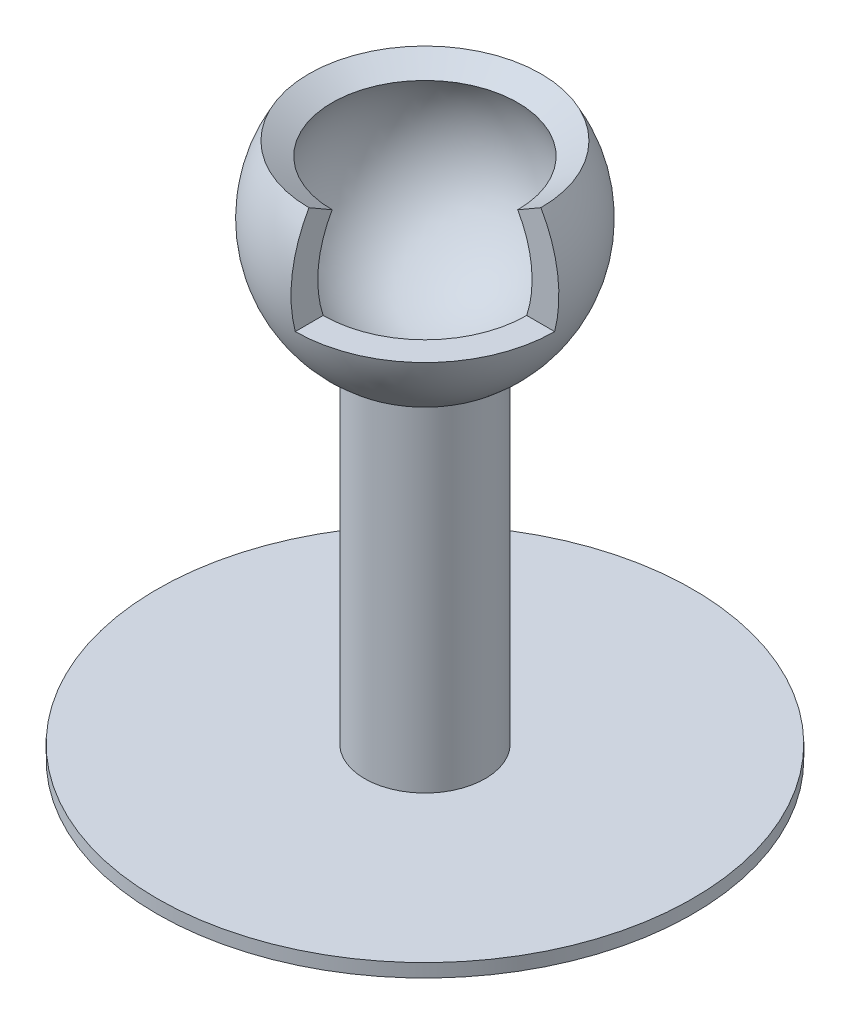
ISO-10303-21;
HEADER;
FILE_DESCRIPTION(('STEP AP214'),'2;1');
FILE_NAME('part.step','',(''),(''),'','','');
FILE_SCHEMA(('AUTOMOTIVE_DESIGN { 1 0 10303 214 1 1 1 1 }'));
ENDSEC;
DATA;
#1=APPLICATION_CONTEXT('core data for automotive mechanical design processes');
#2=APPLICATION_PROTOCOL_DEFINITION('international standard','automotive_design',2000,#1);
#3=PRODUCT_CONTEXT('',#1,'mechanical');
#4=PRODUCT('Part','Part','',(#3));
#5=PRODUCT_RELATED_PRODUCT_CATEGORY('part','',(#4));
#6=PRODUCT_DEFINITION_FORMATION('','',#4);
#7=PRODUCT_DEFINITION_CONTEXT('part definition',#1,'design');
#8=PRODUCT_DEFINITION('design','',#6,#7);
#9=PRODUCT_DEFINITION_SHAPE('','',#8);
#10=(LENGTH_UNIT() NAMED_UNIT(*) SI_UNIT(.MILLI.,.METRE.));
#11=(NAMED_UNIT(*) PLANE_ANGLE_UNIT() SI_UNIT($,.RADIAN.));
#12=(NAMED_UNIT(*) SI_UNIT($,.STERADIAN.) SOLID_ANGLE_UNIT());
#13=UNCERTAINTY_MEASURE_WITH_UNIT(LENGTH_MEASURE(1.E-05),#10,'distance_accuracy_value','');
#14=(GEOMETRIC_REPRESENTATION_CONTEXT(3) GLOBAL_UNCERTAINTY_ASSIGNED_CONTEXT((#13)) GLOBAL_UNIT_ASSIGNED_CONTEXT((#10,
#11,#12)) REPRESENTATION_CONTEXT('',''));
#15=CARTESIAN_POINT('',(0.,0.,0.));
#16=DIRECTION('',(0.,0.,1.));
#17=DIRECTION('',(1.,0.,0.));
#18=AXIS2_PLACEMENT_3D('',#15,#16,#17);
#19=CARTESIAN_POINT('',(0.,0.,0.));
#20=DIRECTION('',(0.,1.,0.));
#21=DIRECTION('',(-1.,0.,0.));
#22=AXIS2_PLACEMENT_3D('',#19,#20,#21);
#23=SPHERICAL_SURFACE('',#22,20.);
#24=CARTESIAN_POINT('',(0.,-17.8605710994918,0.));
#25=DIRECTION('',(0.,1.,0.));
#26=DIRECTION('',(0.,0.,1.));
#27=AXIS2_PLACEMENT_3D('',#24,#25,#26);
#28=CIRCLE('',#27,9.);
#29=CARTESIAN_POINT('',(0.,-17.8605710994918,9.));
#30=VERTEX_POINT('',#29);
#31=EDGE_CURVE('E92',#30,#30,#28,.T.);
#32=ORIENTED_EDGE('',*,*,#31,.T.);
#33=EDGE_LOOP('',(#32));
#34=FACE_BOUND('',#33,.T.);
#35=CARTESIAN_POINT('',(0.,0.,0.));
#36=DIRECTION('',(1.,0.,0.));
#37=DIRECTION('',(0.,0.,-1.));
#38=AXIS2_PLACEMENT_3D('',#35,#36,#37);
#39=CIRCLE('',#38,20.);
#40=CARTESIAN_POINT('',(0.,10.0000000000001,17.3205080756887));
#41=VERTEX_POINT('',#40);
#42=CARTESIAN_POINT('',(0.,-4.99999999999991,19.3649167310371));
#43=VERTEX_POINT('',#42);
#44=EDGE_CURVE('E74',#41,#43,#39,.T.);
#45=ORIENTED_EDGE('',*,*,#44,.F.);
#46=CARTESIAN_POINT('',(0.,10.0000000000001,0.));
#47=DIRECTION('',(0.,1.,0.));
#48=DIRECTION('',(0.,0.,1.));
#49=AXIS2_PLACEMENT_3D('',#46,#47,#48);
#50=CIRCLE('',#49,17.3205080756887);
#51=CARTESIAN_POINT('',(17.3205080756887,10.0000000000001,0.));
#52=VERTEX_POINT('',#51);
#53=EDGE_CURVE('E84',#52,#41,#50,.T.);
#54=ORIENTED_EDGE('',*,*,#53,.F.);
#55=CARTESIAN_POINT('',(0.,0.,0.));
#56=DIRECTION('',(0.,0.,1.));
#57=DIRECTION('',(1.,0.,0.));
#58=AXIS2_PLACEMENT_3D('',#55,#56,#57);
#59=CIRCLE('',#58,20.);
#60=CARTESIAN_POINT('',(19.3649167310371,-4.99999999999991,0.));
#61=VERTEX_POINT('',#60);
#62=EDGE_CURVE('E48',#61,#52,#59,.T.);
#63=ORIENTED_EDGE('',*,*,#62,.F.);
#64=CARTESIAN_POINT('',(0.,-4.99999999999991,0.));
#65=DIRECTION('',(0.,1.,0.));
#66=DIRECTION('',(0.,0.,1.));
#67=AXIS2_PLACEMENT_3D('',#64,#65,#66);
#68=CIRCLE('',#67,19.3649167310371);
#69=EDGE_CURVE('E85',#43,#61,#68,.T.);
#70=ORIENTED_EDGE('',*,*,#69,.F.);
#71=EDGE_LOOP('',(#45,#54,#63,#70));
#72=FACE_BOUND('',#71,.T.);
#73=ADVANCED_FACE('F33',(#34,#72),#23,.T.);
#74=CARTESIAN_POINT('',(0.,0.,0.));
#75=DIRECTION('',(0.,1.,0.));
#76=DIRECTION('',(1.,0.,0.));
#77=AXIS2_PLACEMENT_3D('',#74,#75,#76);
#78=SPHERICAL_SURFACE('',#77,16.);
#79=CARTESIAN_POINT('',(0.,0.,0.));
#80=DIRECTION('',(1.,0.,0.));
#81=DIRECTION('',(0.,0.,-1.));
#82=AXIS2_PLACEMENT_3D('',#79,#80,#81);
#83=CIRCLE('',#82,16.);
#84=CARTESIAN_POINT('',(0.,-4.99999999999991,15.1986841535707));
#85=VERTEX_POINT('',#84);
#86=CARTESIAN_POINT('',(0.,8.00000000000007,13.856406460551));
#87=VERTEX_POINT('',#86);
#88=EDGE_CURVE('E56',#85,#87,#83,.F.);
#89=ORIENTED_EDGE('',*,*,#88,.F.);
#90=CARTESIAN_POINT('',(0.,-4.99999999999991,0.));
#91=DIRECTION('',(0.,1.,0.));
#92=DIRECTION('',(0.,0.,1.));
#93=AXIS2_PLACEMENT_3D('',#90,#91,#92);
#94=CIRCLE('',#93,15.1986841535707);
#95=CARTESIAN_POINT('',(15.1986841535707,-4.99999999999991,0.));
#96=VERTEX_POINT('',#95);
#97=EDGE_CURVE('E11',#96,#85,#94,.F.);
#98=ORIENTED_EDGE('',*,*,#97,.F.);
#99=CARTESIAN_POINT('',(0.,0.,0.));
#100=DIRECTION('',(0.,0.,1.));
#101=DIRECTION('',(1.,0.,0.));
#102=AXIS2_PLACEMENT_3D('',#99,#100,#101);
#103=CIRCLE('',#102,16.);
#104=CARTESIAN_POINT('',(13.856406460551,8.00000000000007,0.));
#105=VERTEX_POINT('',#104);
#106=EDGE_CURVE('E107',#105,#96,#103,.F.);
#107=ORIENTED_EDGE('',*,*,#106,.F.);
#108=CARTESIAN_POINT('',(0.,8.00000000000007,0.));
#109=DIRECTION('',(0.,1.,0.));
#110=DIRECTION('',(0.,0.,1.));
#111=AXIS2_PLACEMENT_3D('',#108,#109,#110);
#112=CIRCLE('',#111,13.856406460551);
#113=EDGE_CURVE('E89',#105,#87,#112,.T.);
#114=ORIENTED_EDGE('',*,*,#113,.T.);
#115=EDGE_LOOP('',(#89,#98,#107,#114));
#116=FACE_BOUND('',#115,.T.);
#117=ADVANCED_FACE('F111',(#116),#78,.F.);
#118=CARTESIAN_POINT('',(0.,10.0000000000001,0.));
#119=DIRECTION('',(0.,1.,0.));
#120=DIRECTION('',(0.,0.,1.));
#121=AXIS2_PLACEMENT_3D('',#118,#119,#120);
#122=CONICAL_SURFACE('',#121,17.3205080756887,1.04719755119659);
#123=DIRECTION('',(0.,-0.500000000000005,-0.866025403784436));
#124=VECTOR('',#123,1.);
#125=CARTESIAN_POINT('',(0.,0.,0.));
#126=LINE('',#125,#124);
#127=EDGE_CURVE('E41',#87,#41,#126,.F.);
#128=ORIENTED_EDGE('',*,*,#127,.F.);
#129=ORIENTED_EDGE('',*,*,#113,.F.);
#130=DIRECTION('',(0.866025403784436,0.500000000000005,0.));
#131=VECTOR('',#130,1.);
#132=CARTESIAN_POINT('',(0.,0.,0.));
#133=LINE('',#132,#131);
#134=EDGE_CURVE('E80',#52,#105,#133,.F.);
#135=ORIENTED_EDGE('',*,*,#134,.F.);
#136=ORIENTED_EDGE('',*,*,#53,.T.);
#137=EDGE_LOOP('',(#128,#129,#135,#136));
#138=FACE_BOUND('',#137,.T.);
#139=ADVANCED_FACE('F87',(#138),#122,.F.);
#140=CARTESIAN_POINT('',(0.,-68.,0.));
#141=DIRECTION('',(0.,1.,0.));
#142=DIRECTION('',(0.,0.,1.));
#143=AXIS2_PLACEMENT_3D('',#140,#141,#142);
#144=PLANE('',#143);
#145=CARTESIAN_POINT('',(0.,-68.,0.));
#146=DIRECTION('',(0.,1.,0.));
#147=DIRECTION('',(0.,0.,1.));
#148=AXIS2_PLACEMENT_3D('',#145,#146,#147);
#149=CIRCLE('',#148,40.);
#150=CARTESIAN_POINT('',(0.,-68.,40.));
#151=VERTEX_POINT('',#150);
#152=EDGE_CURVE('E100',#151,#151,#149,.T.);
#153=ORIENTED_EDGE('',*,*,#152,.T.);
#154=EDGE_LOOP('',(#153));
#155=FACE_BOUND('',#154,.T.);
#156=CARTESIAN_POINT('',(0.,-68.,0.));
#157=DIRECTION('',(0.,1.,0.));
#158=DIRECTION('',(0.,0.,1.));
#159=AXIS2_PLACEMENT_3D('',#156,#157,#158);
#160=CIRCLE('',#159,9.);
#161=CARTESIAN_POINT('',(0.,-68.,9.));
#162=VERTEX_POINT('',#161);
#163=EDGE_CURVE('E88',#162,#162,#160,.T.);
#164=ORIENTED_EDGE('',*,*,#163,.F.);
#165=EDGE_LOOP('',(#164));
#166=FACE_BOUND('',#165,.T.);
#167=ADVANCED_FACE('F142',(#155,#166),#144,.T.);
#168=CARTESIAN_POINT('',(0.,-68.,0.));
#169=DIRECTION('',(0.,-1.,0.));
#170=DIRECTION('',(0.,0.,-1.));
#171=AXIS2_PLACEMENT_3D('',#168,#169,#170);
#172=CYLINDRICAL_SURFACE('',#171,40.);
#173=ORIENTED_EDGE('',*,*,#152,.F.);
#174=EDGE_LOOP('',(#173));
#175=FACE_BOUND('',#174,.T.);
#176=CARTESIAN_POINT('',(0.,-70.,0.));
#177=DIRECTION('',(0.,1.,0.));
#178=DIRECTION('',(0.,0.,1.));
#179=AXIS2_PLACEMENT_3D('',#176,#177,#178);
#180=CIRCLE('',#179,40.);
#181=CARTESIAN_POINT('',(0.,-70.,40.));
#182=VERTEX_POINT('',#181);
#183=EDGE_CURVE('E99',#182,#182,#180,.T.);
#184=ORIENTED_EDGE('',*,*,#183,.T.);
#185=EDGE_LOOP('',(#184));
#186=FACE_BOUND('',#185,.T.);
#187=ADVANCED_FACE('F35',(#175,#186),#172,.T.);
#188=CARTESIAN_POINT('',(0.,-70.,0.));
#189=DIRECTION('',(0.,1.,0.));
#190=DIRECTION('',(0.,0.,1.));
#191=AXIS2_PLACEMENT_3D('',#188,#189,#190);
#192=PLANE('',#191);
#193=ORIENTED_EDGE('',*,*,#183,.F.);
#194=EDGE_LOOP('',(#193));
#195=FACE_BOUND('',#194,.T.);
#196=ADVANCED_FACE('F129',(#195),#192,.F.);
#197=CARTESIAN_POINT('',(0.,20.001,0.));
#198=DIRECTION('',(0.,-1.,0.));
#199=DIRECTION('',(0.,0.,-1.));
#200=AXIS2_PLACEMENT_3D('',#197,#198,#199);
#201=CYLINDRICAL_SURFACE('',#200,9.);
#202=ORIENTED_EDGE('',*,*,#163,.T.);
#203=EDGE_LOOP('',(#202));
#204=FACE_BOUND('',#203,.T.);
#205=ORIENTED_EDGE('',*,*,#31,.F.);
#206=EDGE_LOOP('',(#205));
#207=FACE_BOUND('',#206,.T.);
#208=ADVANCED_FACE('F122',(#204,#207),#201,.T.);
#209=CARTESIAN_POINT('',(0.,-4.99999999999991,26.3098245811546));
#210=DIRECTION('',(0.,1.,0.));
#211=DIRECTION('',(0.,0.,1.));
#212=AXIS2_PLACEMENT_3D('',#209,#210,#211);
#213=PLANE('',#212);
#214=ORIENTED_EDGE('',*,*,#69,.T.);
#215=DIRECTION('',(1.,0.,0.));
#216=VECTOR('',#215,1.);
#217=CARTESIAN_POINT('',(0.,-4.99999999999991,0.));
#218=LINE('',#217,#216);
#219=EDGE_CURVE('E112',#96,#61,#218,.T.);
#220=ORIENTED_EDGE('',*,*,#219,.F.);
#221=ORIENTED_EDGE('',*,*,#97,.T.);
#222=DIRECTION('',(0.,0.,-1.));
#223=VECTOR('',#222,1.);
#224=CARTESIAN_POINT('',(0.,-4.99999999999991,0.));
#225=LINE('',#224,#223);
#226=EDGE_CURVE('E115',#43,#85,#225,.T.);
#227=ORIENTED_EDGE('',*,*,#226,.F.);
#228=EDGE_LOOP('',(#214,#220,#221,#227));
#229=FACE_BOUND('',#228,.T.);
#230=ADVANCED_FACE('F120',(#229),#213,.T.);
#231=CARTESIAN_POINT('',(0.,-4.99999999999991,0.));
#232=DIRECTION('',(1.,0.,0.));
#233=DIRECTION('',(0.,0.,-1.));
#234=AXIS2_PLACEMENT_3D('',#231,#232,#233);
#235=PLANE('',#234);
#236=ORIENTED_EDGE('',*,*,#44,.T.);
#237=ORIENTED_EDGE('',*,*,#226,.T.);
#238=ORIENTED_EDGE('',*,*,#88,.T.);
#239=ORIENTED_EDGE('',*,*,#127,.T.);
#240=EDGE_LOOP('',(#236,#237,#238,#239));
#241=FACE_BOUND('',#240,.T.);
#242=ADVANCED_FACE('F73',(#241),#235,.T.);
#243=CARTESIAN_POINT('',(0.,-4.99999999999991,0.));
#244=DIRECTION('',(0.,0.,1.));
#245=DIRECTION('',(1.,0.,0.));
#246=AXIS2_PLACEMENT_3D('',#243,#244,#245);
#247=PLANE('',#246);
#248=ORIENTED_EDGE('',*,*,#62,.T.);
#249=ORIENTED_EDGE('',*,*,#134,.T.);
#250=ORIENTED_EDGE('',*,*,#106,.T.);
#251=ORIENTED_EDGE('',*,*,#219,.T.);
#252=EDGE_LOOP('',(#248,#249,#250,#251));
#253=FACE_BOUND('',#252,.T.);
#254=ADVANCED_FACE('F106',(#253),#247,.T.);
#255=CLOSED_SHELL('',(#73,#117,#139,#167,#187,#196,#208,#230,#242,#254));
#256=MANIFOLD_SOLID_BREP('B2',#255);
#257=ADVANCED_BREP_SHAPE_REPRESENTATION('',(#18,#256),#14);
#258=SHAPE_DEFINITION_REPRESENTATION(#9,#257);
ENDSEC;
END-ISO-10303-21;
